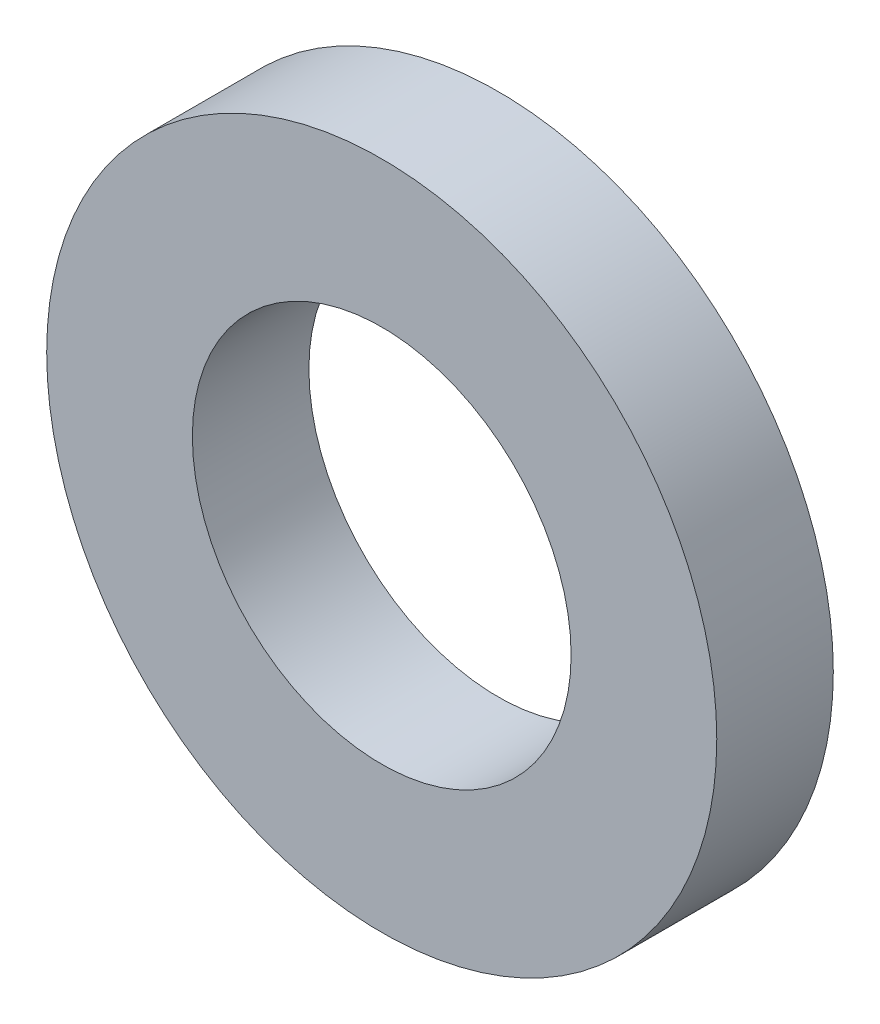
ISO-10303-21;
HEADER;
FILE_DESCRIPTION(('STEP AP214'),'2;1');
FILE_NAME('part.step','',(''),(''),'','','');
FILE_SCHEMA(('AUTOMOTIVE_DESIGN { 1 0 10303 214 1 1 1 1 }'));
ENDSEC;
DATA;
#1=APPLICATION_CONTEXT('core data for automotive mechanical design processes');
#2=APPLICATION_PROTOCOL_DEFINITION('international standard','automotive_design',2000,#1);
#3=PRODUCT_CONTEXT('',#1,'mechanical');
#4=PRODUCT('Part','Part','',(#3));
#5=PRODUCT_RELATED_PRODUCT_CATEGORY('part','',(#4));
#6=PRODUCT_DEFINITION_FORMATION('','',#4);
#7=PRODUCT_DEFINITION_CONTEXT('part definition',#1,'design');
#8=PRODUCT_DEFINITION('design','',#6,#7);
#9=PRODUCT_DEFINITION_SHAPE('','',#8);
#10=(LENGTH_UNIT() NAMED_UNIT(*) SI_UNIT(.MILLI.,.METRE.));
#11=(NAMED_UNIT(*) PLANE_ANGLE_UNIT() SI_UNIT($,.RADIAN.));
#12=(NAMED_UNIT(*) SI_UNIT($,.STERADIAN.) SOLID_ANGLE_UNIT());
#13=UNCERTAINTY_MEASURE_WITH_UNIT(LENGTH_MEASURE(1.E-05),#10,'distance_accuracy_value','');
#14=(GEOMETRIC_REPRESENTATION_CONTEXT(3) GLOBAL_UNCERTAINTY_ASSIGNED_CONTEXT((#13)) GLOBAL_UNIT_ASSIGNED_CONTEXT((#10,
#11,#12)) REPRESENTATION_CONTEXT('',''));
#15=CARTESIAN_POINT('',(0.,0.,0.));
#16=DIRECTION('',(0.,0.,1.));
#17=DIRECTION('',(1.,0.,0.));
#18=AXIS2_PLACEMENT_3D('',#15,#16,#17);
#19=CARTESIAN_POINT('',(-120.749995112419,120.749995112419,0.));
#20=DIRECTION('',(0.,0.,-1.));
#21=DIRECTION('',(1.,0.,0.));
#22=AXIS2_PLACEMENT_3D('',#19,#20,#21);
#23=PLANE('',#22);
#24=CARTESIAN_POINT('',(0.,0.,0.));
#25=DIRECTION('',(0.,0.,1.));
#26=DIRECTION('',(1.,0.,0.));
#27=AXIS2_PLACEMENT_3D('',#24,#25,#26);
#28=CIRCLE('',#27,65.);
#29=CARTESIAN_POINT('',(65.,0.,0.));
#30=VERTEX_POINT('',#29);
#31=EDGE_CURVE('E10',#30,#30,#28,.T.);
#32=ORIENTED_EDGE('',*,*,#31,.T.);
#33=EDGE_LOOP('',(#32));
#34=FACE_BOUND('',#33,.T.);
#35=CARTESIAN_POINT('',(0.,0.,0.));
#36=DIRECTION('',(0.,0.,1.));
#37=DIRECTION('',(1.,0.,0.));
#38=AXIS2_PLACEMENT_3D('',#35,#36,#37);
#39=CIRCLE('',#38,115.);
#40=CARTESIAN_POINT('',(115.,0.,0.));
#41=VERTEX_POINT('',#40);
#42=EDGE_CURVE('E25',#41,#41,#39,.T.);
#43=ORIENTED_EDGE('',*,*,#42,.F.);
#44=EDGE_LOOP('',(#43));
#45=FACE_BOUND('',#44,.T.);
#46=ADVANCED_FACE('F15',(#34,#45),#23,.T.);
#47=CARTESIAN_POINT('',(0.,0.,0.));
#48=DIRECTION('',(0.,0.,1.));
#49=DIRECTION('',(1.,0.,0.));
#50=AXIS2_PLACEMENT_3D('',#47,#48,#49);
#51=CYLINDRICAL_SURFACE('',#50,115.);
#52=ORIENTED_EDGE('',*,*,#42,.T.);
#53=DIRECTION('',(0.,0.,-1.));
#54=VECTOR('',#53,1.);
#55=CARTESIAN_POINT('',(115.,0.,20.));
#56=LINE('',#55,#54);
#57=CARTESIAN_POINT('',(115.,0.,40.));
#58=VERTEX_POINT('',#57);
#59=EDGE_CURVE('E45',#58,#41,#56,.T.);
#60=ORIENTED_EDGE('',*,*,#59,.F.);
#61=CARTESIAN_POINT('',(0.,0.,40.));
#62=DIRECTION('',(0.,0.,-1.));
#63=DIRECTION('',(-1.,0.,0.));
#64=AXIS2_PLACEMENT_3D('',#61,#62,#63);
#65=CIRCLE('',#64,115.);
#66=EDGE_CURVE('E40',#58,#58,#65,.T.);
#67=ORIENTED_EDGE('',*,*,#66,.T.);
#68=ORIENTED_EDGE('',*,*,#59,.T.);
#69=EDGE_LOOP('',(#52,#60,#67,#68));
#70=FACE_BOUND('',#69,.T.);
#71=ADVANCED_FACE('F58',(#70),#51,.T.);
#72=CARTESIAN_POINT('',(120.749995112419,-120.749995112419,40.));
#73=DIRECTION('',(0.,0.,1.));
#74=DIRECTION('',(0.,1.,0.));
#75=AXIS2_PLACEMENT_3D('',#72,#73,#74);
#76=PLANE('',#75);
#77=CARTESIAN_POINT('',(0.,0.,40.));
#78=DIRECTION('',(0.,0.,-1.));
#79=DIRECTION('',(-1.,0.,0.));
#80=AXIS2_PLACEMENT_3D('',#77,#78,#79);
#81=CIRCLE('',#80,65.0000000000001);
#82=CARTESIAN_POINT('',(65.,0.,40.));
#83=VERTEX_POINT('',#82);
#84=EDGE_CURVE('E49',#83,#83,#81,.T.);
#85=ORIENTED_EDGE('',*,*,#84,.T.);
#86=EDGE_LOOP('',(#85));
#87=FACE_BOUND('',#86,.T.);
#88=ORIENTED_EDGE('',*,*,#66,.F.);
#89=EDGE_LOOP('',(#88));
#90=FACE_BOUND('',#89,.T.);
#91=ADVANCED_FACE('F41',(#87,#90),#76,.T.);
#92=CARTESIAN_POINT('',(0.,0.,0.));
#93=DIRECTION('',(0.,0.,1.));
#94=DIRECTION('',(1.,0.,0.));
#95=AXIS2_PLACEMENT_3D('',#92,#93,#94);
#96=CYLINDRICAL_SURFACE('',#95,65.);
#97=ORIENTED_EDGE('',*,*,#84,.F.);
#98=DIRECTION('',(0.,0.,1.));
#99=VECTOR('',#98,1.);
#100=CARTESIAN_POINT('',(65.,0.,20.));
#101=LINE('',#100,#99);
#102=EDGE_CURVE('E19',#30,#83,#101,.T.);
#103=ORIENTED_EDGE('',*,*,#102,.F.);
#104=ORIENTED_EDGE('',*,*,#31,.F.);
#105=ORIENTED_EDGE('',*,*,#102,.T.);
#106=EDGE_LOOP('',(#97,#103,#104,#105));
#107=FACE_BOUND('',#106,.T.);
#108=ADVANCED_FACE('F17',(#107),#96,.F.);
#109=CLOSED_SHELL('',(#46,#71,#91,#108));
#110=MANIFOLD_SOLID_BREP('B1',#109);
#111=ADVANCED_BREP_SHAPE_REPRESENTATION('',(#18,#110),#14);
#112=SHAPE_DEFINITION_REPRESENTATION(#9,#111);
ENDSEC;
END-ISO-10303-21;
